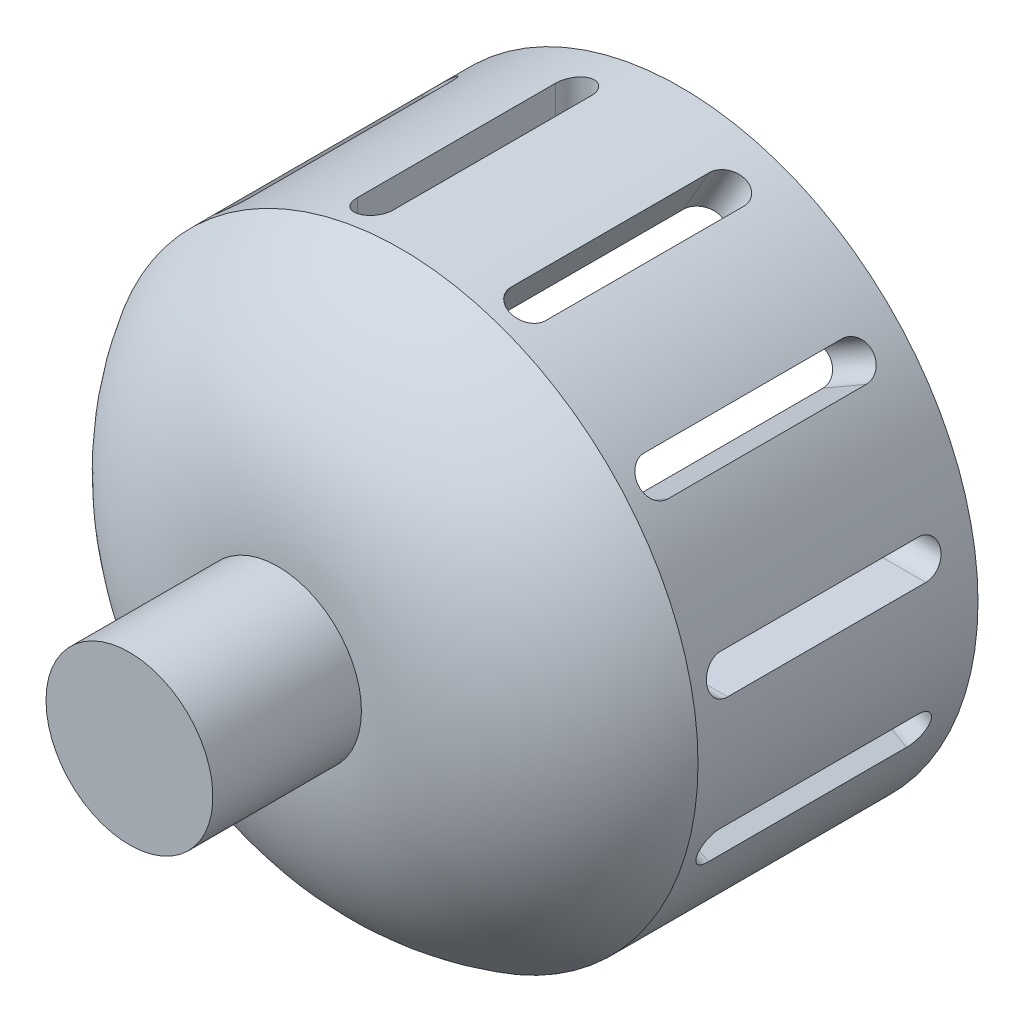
from build123d import *

# Parameters (mm, degrees)
SKETCH1_R                      = 10.7
BOSS_EXTRUDE1_DEPTH            = 19.05
CUT_EXTRUDE3_REACH             = 101.638
CUT_EXTRUDE3_DIRECTION_2_DEPTH = 100.637501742
CIRPATTERN1_COUNT              = 12


with BuildPart() as part:
    # Sketch1 → Boss-Extrude1 (new body)
    with BuildSketch(Plane.XY):
        with Locations(Location((0, 0, 0), (0, 0, 180))):
            Circle(SKETCH1_R)
    extrude(amount=BOSS_EXTRUDE1_DEPTH)

    # Sketch2 → Revolve1 (revolve)
    with BuildSketch(Plane(origin=(0, 0, 0), x_dir=(1, 0, 0), z_dir=(0, 1, 0))):
        with BuildLine():
            Line((0, 0), (10.7, 0))
            ThreePointArc((10.7, 0), (26.505792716, 4.22250768), (38.1, 15.764908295))
            Line((38.1, 15.764908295), (38.1, 51.667995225))
            Line((38.1, 51.667995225), (0, 51.667995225))
            Line((0, 51.667995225), (0, 0))
        make_face()
    revolve(axis=Axis((0, 0, 70.364834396), (0, 0, -1)))

    # Sketch6 → Cut-Revolve3 (revolve, cut)
    with BuildSketch(Plane(origin=(0, 0, 0), x_dir=(1, 0, 0), z_dir=(0, 1, 0)), mode=Mode.PRIVATE) as cut_revolve3_sk:
        with BuildLine():
            Line((-31.75, 51.755330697), (0, 51.755330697))
            Line((0, 51.755330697), (0, 6.35))
            Line((0, 6.35), (-10.7, 6.35))
            add(Edge.make_bspline(
                [(-31.75, 15.764908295), (-23.61746522, 5.861815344), (-10.7, 6.35)],
                knots=[0, 0, 0, 1, 1, 1], degree=2))
            Line((-31.75, 15.764908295), (-31.75, 51.755330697))
        make_face()
    revolve(cut_revolve3_sk.sketch.rotate(Axis((0, 0, 0), (0, 0, -1)), 180), axis=Axis((0, 0, 0), (0, 0, -1)), mode=Mode.SUBTRACT)

    # Sketch5 → Cut-Extrude3 (cut, up to next)
    with BuildSketch(Plane(origin=(38.1, 0, 0), x_dir=(0, 0, -1), z_dir=(1, 0, 0)), mode=Mode.PRIVATE) as cut_extrude3_sk1:
        with BuildLine():
            Line((19.917995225, 9.738631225), (45.317995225, 9.738631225))
            ThreePointArc((45.317995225, 9.738631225), (47.617394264, 7.439232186), (45.317995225, 5.139833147))
            Line((45.317995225, 5.139833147), (19.917995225, 5.139833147))
            ThreePointArc((19.917995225, 5.139833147), (17.618596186, 7.439232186), (19.917995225, 9.738631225))
        make_face()
    cut_extrude3_tool1 = extrude(cut_extrude3_sk1.sketch, amount=-CUT_EXTRUDE3_REACH, mode=Mode.PRIVATE) & part.part
    cut_extrude3 = cut_extrude3_tool1.solids().sort_by_distance((38.1, 7.439232, -32.617995))[0]
    add(cut_extrude3, mode=Mode.SUBTRACT)

    # Sketch5 → Cut-Extrude3 direction 2 (cut)
    with BuildSketch(Plane(origin=(38.1, 0, 0), x_dir=(0, 0, -1), z_dir=(1, 0, 0))):
        with BuildLine():
            Line((19.917995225, 9.738631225), (45.317995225, 9.738631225))
            ThreePointArc((45.317995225, 9.738631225), (47.617394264, 7.439232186), (45.317995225, 5.139833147))
            Line((45.317995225, 5.139833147), (19.917995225, 5.139833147))
            ThreePointArc((19.917995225, 5.139833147), (17.618596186, 7.439232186), (19.917995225, 9.738631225))
        make_face()
    cut_extrude3_direction_2 = extrude(amount=CUT_EXTRUDE3_DIRECTION_2_DEPTH, mode=Mode.SUBTRACT)

    # CirPattern1: Cut-Extrude3, Cut-Extrude3 direction 2 ×12 about axis
    cirpattern1_axis = Axis((0, 0, 0), (0, 0, 1))
    add([cut_extrude3.rotate(cirpattern1_axis, i * 360 / CIRPATTERN1_COUNT) for i in range(1, CIRPATTERN1_COUNT)], mode=Mode.SUBTRACT)
    add([cut_extrude3_direction_2.rotate(cirpattern1_axis, i * 360 / CIRPATTERN1_COUNT) for i in range(1, CIRPATTERN1_COUNT)], mode=Mode.SUBTRACT)


solid = part.part
